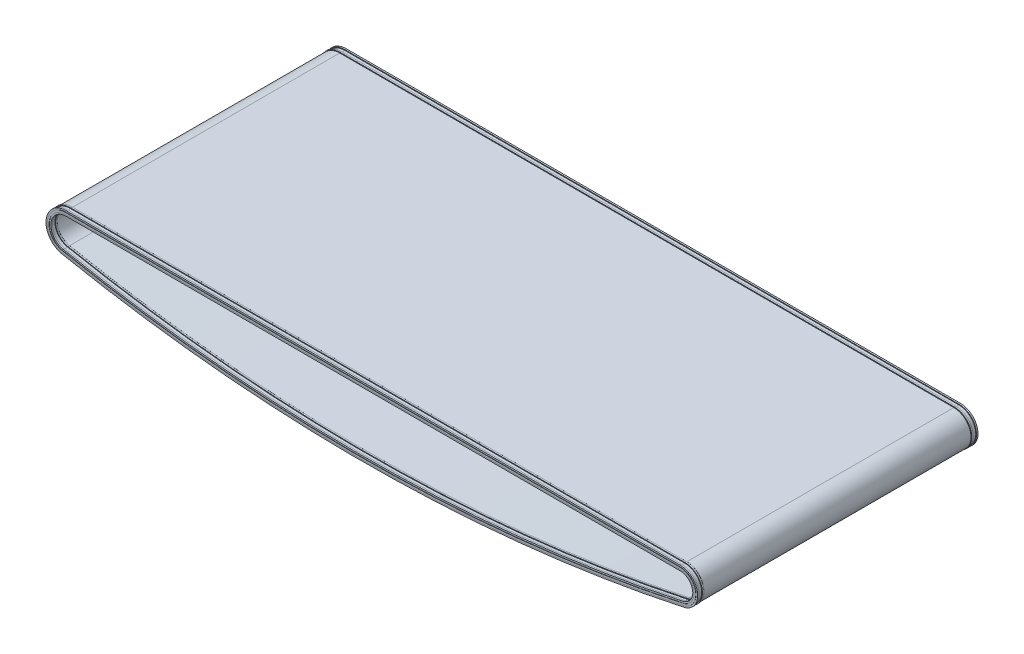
from build123d import *


with BuildPart() as part:
    # Balayage1: sweep along a path in Esquisse1
    with BuildLine(Plane.XY) as balayage1_path:
        Line((744.993878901, 0), (-744.993878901, 0))
        ThreePointArc((-744.993878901, 0), (-787.398657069, -38.433052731), (-753.307538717, -84.401089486))
        ThreePointArc((-753.307538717, -84.401089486), (0.317638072, -155.583211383), (752.703654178, -72.318066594))
        ThreePointArc((752.703654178, -72.318066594), (781.357814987, -32.693267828), (744.993878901, 0))
    # Esquisse2 → Balayage1 (sweep)
    with BuildSketch(Plane(origin=(0, 0, 0), x_dir=(0, 0, -1), z_dir=(1, 0, 0))):
        Polygon((-340.805, 2.2), (-340.805, -2.2), (-340.075, -2.2), (-340.075, -5.9), (-336.375, -5.9), (-336.375, -4.25), (-328.625, -4.25), (-328.625, -5.9), (-324.925, -5.9), (-324.925, -2.2), (-324.195, -2.2), (-324.195, -1.5), (-323.995, -1.5), (-323.995, -5), (323.995, -5), (323.995, -1.5), (324.195, -1.5), (324.195, -2.2), (324.925, -2.2), (324.925, -5.9), (328.625, -5.9), (328.625, -4.25), (336.375, -4.25), (336.375, -5.9), (340.075, -5.9), (340.075, -2.2), (340.805, -2.2), (340.805, 2.2), (340.075, 2.2), (340.075, 5.9), (336.375, 5.9), (336.375, 4.25), (328.625, 4.25), (328.625, 5.9), (324.925, 5.9), (324.925, 2.2), (324.195, 2.2), (324.195, 1.5), (323.995, 1.5), (323.995, 5), (-323.995, 5), (-323.995, 1.5), (-324.195, 1.5), (-324.195, 2.2), (-324.925, 2.2), (-324.925, 5.9), (-328.625, 5.9), (-328.625, 4.25), (-336.375, 4.25), (-336.375, 5.9), (-340.075, 5.9), (-340.075, 2.2), align=None)
    sweep(path=balayage1_path.line)


solid = part.part
